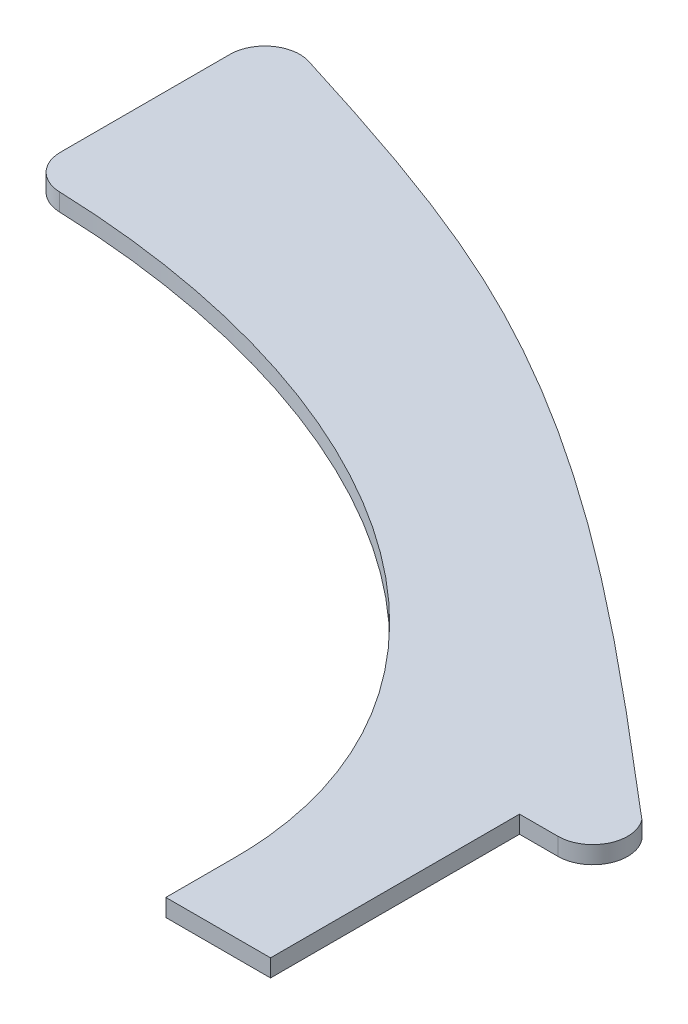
ISO-10303-21;
HEADER;
FILE_DESCRIPTION(('STEP AP214'),'2;1');
FILE_NAME('part.step','',(''),(''),'','','');
FILE_SCHEMA(('AUTOMOTIVE_DESIGN { 1 0 10303 214 1 1 1 1 }'));
ENDSEC;
DATA;
#1=APPLICATION_CONTEXT('core data for automotive mechanical design processes');
#2=APPLICATION_PROTOCOL_DEFINITION('international standard','automotive_design',2000,#1);
#3=PRODUCT_CONTEXT('',#1,'mechanical');
#4=PRODUCT('Part','Part','',(#3));
#5=PRODUCT_RELATED_PRODUCT_CATEGORY('part','',(#4));
#6=PRODUCT_DEFINITION_FORMATION('','',#4);
#7=PRODUCT_DEFINITION_CONTEXT('part definition',#1,'design');
#8=PRODUCT_DEFINITION('design','',#6,#7);
#9=PRODUCT_DEFINITION_SHAPE('','',#8);
#10=(LENGTH_UNIT() NAMED_UNIT(*) SI_UNIT(.MILLI.,.METRE.));
#11=(NAMED_UNIT(*) PLANE_ANGLE_UNIT() SI_UNIT($,.RADIAN.));
#12=(NAMED_UNIT(*) SI_UNIT($,.STERADIAN.) SOLID_ANGLE_UNIT());
#13=UNCERTAINTY_MEASURE_WITH_UNIT(LENGTH_MEASURE(1.E-05),#10,'distance_accuracy_value','');
#14=(GEOMETRIC_REPRESENTATION_CONTEXT(3) GLOBAL_UNCERTAINTY_ASSIGNED_CONTEXT((#13)) GLOBAL_UNIT_ASSIGNED_CONTEXT((#10,
#11,#12)) REPRESENTATION_CONTEXT('',''));
#15=CARTESIAN_POINT('',(0.,0.,0.));
#16=DIRECTION('',(0.,0.,1.));
#17=DIRECTION('',(1.,0.,0.));
#18=AXIS2_PLACEMENT_3D('',#15,#16,#17);
#19=CARTESIAN_POINT('',(-12.6572245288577,6.35,-65.1923829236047));
#20=DIRECTION('',(0.,0.,-1.));
#21=DIRECTION('',(-1.,0.,0.));
#22=AXIS2_PLACEMENT_3D('',#19,#20,#21);
#23=PLANE('',#22);
#24=DIRECTION('',(1.,0.,0.));
#25=VECTOR('',#24,1.);
#26=CARTESIAN_POINT('',(-12.6572245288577,0.,-65.1923829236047));
#27=LINE('',#26,#25);
#28=CARTESIAN_POINT('',(-12.6572245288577,0.,-65.1923829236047));
#29=VERTEX_POINT('',#28);
#30=CARTESIAN_POINT('',(1.32065538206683,0.,-65.1923829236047));
#31=VERTEX_POINT('',#30);
#32=EDGE_CURVE('E140',#29,#31,#27,.T.);
#33=ORIENTED_EDGE('',*,*,#32,.T.);
#34=DIRECTION('',(0.,-1.,0.));
#35=VECTOR('',#34,1.);
#36=CARTESIAN_POINT('',(1.32065538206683,6.35,-65.1923829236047));
#37=LINE('',#36,#35);
#38=CARTESIAN_POINT('',(1.32065538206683,6.35,-65.1923829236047));
#39=VERTEX_POINT('',#38);
#40=EDGE_CURVE('E11',#39,#31,#37,.T.);
#41=ORIENTED_EDGE('',*,*,#40,.F.);
#42=DIRECTION('',(1.,0.,0.));
#43=VECTOR('',#42,1.);
#44=CARTESIAN_POINT('',(-12.6572245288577,6.35,-65.1923829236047));
#45=LINE('',#44,#43);
#46=CARTESIAN_POINT('',(-12.6572245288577,6.35,-65.1923829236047));
#47=VERTEX_POINT('',#46);
#48=EDGE_CURVE('E165',#47,#39,#45,.T.);
#49=ORIENTED_EDGE('',*,*,#48,.F.);
#50=DIRECTION('',(0.,-1.,0.));
#51=VECTOR('',#50,1.);
#52=CARTESIAN_POINT('',(-12.6572245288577,6.35,-65.1923829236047));
#53=LINE('',#52,#51);
#54=EDGE_CURVE('E136',#47,#29,#53,.T.);
#55=ORIENTED_EDGE('',*,*,#54,.T.);
#56=EDGE_LOOP('',(#33,#41,#49,#55));
#57=FACE_BOUND('',#56,.T.);
#58=ADVANCED_FACE('F31',(#57),#23,.F.);
#59=CARTESIAN_POINT('',(1.32065538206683,6.35,-77.8923829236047));
#60=DIRECTION('',(0.,-1.,0.));
#61=DIRECTION('',(0.,0.,-1.));
#62=AXIS2_PLACEMENT_3D('',#59,#60,#61);
#63=CYLINDRICAL_SURFACE('',#62,12.7);
#64=CARTESIAN_POINT('',(1.32065538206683,0.,-77.8923829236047));
#65=DIRECTION('',(0.,1.,0.));
#66=DIRECTION('',(0.,0.,-1.));
#67=AXIS2_PLACEMENT_3D('',#64,#65,#66);
#68=CIRCLE('',#67,12.7);
#69=CARTESIAN_POINT('',(11.2864434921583,0.,-85.7646803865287));
#70=VERTEX_POINT('',#69);
#71=EDGE_CURVE('E143',#31,#70,#68,.T.);
#72=ORIENTED_EDGE('',*,*,#71,.T.);
#73=DIRECTION('',(0.,-1.,0.));
#74=VECTOR('',#73,1.);
#75=CARTESIAN_POINT('',(11.2864434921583,6.35,-85.7646803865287));
#76=LINE('',#75,#74);
#77=CARTESIAN_POINT('',(11.2864434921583,6.35,-85.7646803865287));
#78=VERTEX_POINT('',#77);
#79=EDGE_CURVE('E39',#78,#70,#76,.T.);
#80=ORIENTED_EDGE('',*,*,#79,.F.);
#81=CARTESIAN_POINT('',(1.32065538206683,6.35,-77.8923829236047));
#82=DIRECTION('',(0.,1.,0.));
#83=DIRECTION('',(0.,0.,-1.));
#84=AXIS2_PLACEMENT_3D('',#81,#82,#83);
#85=CIRCLE('',#84,12.7);
#86=EDGE_CURVE('E94',#39,#78,#85,.T.);
#87=ORIENTED_EDGE('',*,*,#86,.F.);
#88=ORIENTED_EDGE('',*,*,#40,.T.);
#89=EDGE_LOOP('',(#72,#80,#87,#88));
#90=FACE_BOUND('',#89,.T.);
#91=ADVANCED_FACE('F223',(#90),#63,.T.);
#92=CARTESIAN_POINT('',(11.2864434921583,6.35,-85.7646803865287));
#93=CARTESIAN_POINT('',(-51.9960826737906,6.35,-139.632547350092));
#94=CARTESIAN_POINT('',(-142.555462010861,6.35,-216.719239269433));
#95=CARTESIAN_POINT('',(-254.3779025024,6.35,-253.511407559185));
#96=CARTESIAN_POINT('',(-288.2826968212,6.35,-264.065032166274));
#97=B_SPLINE_CURVE_WITH_KNOTS('',3,(#92,#93,#94,#95,#96),.UNSPECIFIED.,.F.,.F.,(4,1,4),(0.,
0.666316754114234,0.953521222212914),.UNSPECIFIED.);
#98=DIRECTION('',(0.,-1.,0.));
#99=VECTOR('',#98,1.);
#100=SURFACE_OF_LINEAR_EXTRUSION('',#97,#99);
#101=CARTESIAN_POINT('',(11.2864434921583,0.,-85.7646803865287));
#102=CARTESIAN_POINT('',(-51.9960826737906,0.,-139.632547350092));
#103=CARTESIAN_POINT('',(-142.555462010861,0.,-216.719239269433));
#104=CARTESIAN_POINT('',(-254.3779025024,0.,-253.511407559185));
#105=CARTESIAN_POINT('',(-288.2826968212,0.,-264.065032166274));
#106=B_SPLINE_CURVE_WITH_KNOTS('',3,(#101,#102,#103,#104,#105),.UNSPECIFIED.,.F.,.F.,(4,1,4),
(0.,0.666316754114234,0.953521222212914),.UNSPECIFIED.);
#107=CARTESIAN_POINT('',(-288.2826968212,0.,-264.065032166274));
#108=VERTEX_POINT('',#107);
#109=EDGE_CURVE('E145',#70,#108,#106,.T.);
#110=ORIENTED_EDGE('',*,*,#109,.T.);
#111=DIRECTION('',(0.,-1.,0.));
#112=VECTOR('',#111,1.);
#113=CARTESIAN_POINT('',(-288.2826968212,6.35,-264.065032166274));
#114=LINE('',#113,#112);
#115=CARTESIAN_POINT('',(-288.2826968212,6.35,-264.065032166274));
#116=VERTEX_POINT('',#115);
#117=EDGE_CURVE('E178',#116,#108,#114,.T.);
#118=ORIENTED_EDGE('',*,*,#117,.F.);
#119=EDGE_CURVE('E186',#78,#116,#97,.T.);
#120=ORIENTED_EDGE('',*,*,#119,.F.);
#121=ORIENTED_EDGE('',*,*,#79,.T.);
#122=EDGE_LOOP('',(#110,#118,#120,#121));
#123=FACE_BOUND('',#122,.T.);
#124=ADVANCED_FACE('F184',(#123),#100,.F.);
#125=CARTESIAN_POINT('',(-292.057224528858,6.35,-251.938905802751));
#126=DIRECTION('',(0.,-1.,0.));
#127=DIRECTION('',(0.,0.,-1.));
#128=AXIS2_PLACEMENT_3D('',#125,#126,#127);
#129=CYLINDRICAL_SURFACE('',#128,12.7);
#130=CARTESIAN_POINT('',(-292.057224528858,0.,-251.938905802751));
#131=DIRECTION('',(0.,1.,0.));
#132=DIRECTION('',(0.,0.,1.));
#133=AXIS2_PLACEMENT_3D('',#130,#131,#132);
#134=CIRCLE('',#133,12.7);
#135=CARTESIAN_POINT('',(-304.757224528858,0.,-251.938905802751));
#136=VERTEX_POINT('',#135);
#137=EDGE_CURVE('E149',#108,#136,#134,.T.);
#138=ORIENTED_EDGE('',*,*,#137,.T.);
#139=DIRECTION('',(0.,-1.,0.));
#140=VECTOR('',#139,1.);
#141=CARTESIAN_POINT('',(-304.757224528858,6.35,-251.938905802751));
#142=LINE('',#141,#140);
#143=CARTESIAN_POINT('',(-304.757224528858,6.35,-251.938905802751));
#144=VERTEX_POINT('',#143);
#145=EDGE_CURVE('E175',#144,#136,#142,.T.);
#146=ORIENTED_EDGE('',*,*,#145,.F.);
#147=CARTESIAN_POINT('',(-292.057224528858,6.35,-251.938905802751));
#148=DIRECTION('',(0.,1.,0.));
#149=DIRECTION('',(0.,0.,1.));
#150=AXIS2_PLACEMENT_3D('',#147,#148,#149);
#151=CIRCLE('',#150,12.7);
#152=EDGE_CURVE('E201',#116,#144,#151,.T.);
#153=ORIENTED_EDGE('',*,*,#152,.F.);
#154=ORIENTED_EDGE('',*,*,#117,.T.);
#155=EDGE_LOOP('',(#138,#146,#153,#154));
#156=FACE_BOUND('',#155,.T.);
#157=ADVANCED_FACE('F192',(#156),#129,.T.);
#158=CARTESIAN_POINT('',(-304.757224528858,6.35,-202.348739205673));
#159=DIRECTION('',(1.,0.,1.19625711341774E-13));
#160=DIRECTION('',(1.19625711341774E-13,0.,-1.));
#161=AXIS2_PLACEMENT_3D('',#158,#159,#160);
#162=PLANE('',#161);
#163=DIRECTION('',(-1.19625711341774E-13,0.,1.));
#164=VECTOR('',#163,1.);
#165=CARTESIAN_POINT('',(-304.757224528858,0.,-202.348739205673));
#166=LINE('',#165,#164);
#167=CARTESIAN_POINT('',(-304.757224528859,0.,-190.283691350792));
#168=VERTEX_POINT('',#167);
#169=EDGE_CURVE('E155',#136,#168,#166,.T.);
#170=ORIENTED_EDGE('',*,*,#169,.T.);
#171=DIRECTION('',(0.,-1.,0.));
#172=VECTOR('',#171,1.);
#173=CARTESIAN_POINT('',(-304.757224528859,6.35,-190.283691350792));
#174=LINE('',#173,#172);
#175=CARTESIAN_POINT('',(-304.757224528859,6.35,-190.283691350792));
#176=VERTEX_POINT('',#175);
#177=EDGE_CURVE('E172',#176,#168,#174,.T.);
#178=ORIENTED_EDGE('',*,*,#177,.F.);
#179=DIRECTION('',(0.,0.,1.));
#180=VECTOR('',#179,1.);
#181=CARTESIAN_POINT('',(-304.757224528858,6.35,-202.348739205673));
#182=LINE('',#181,#180);
#183=EDGE_CURVE('E198',#144,#176,#182,.T.);
#184=ORIENTED_EDGE('',*,*,#183,.F.);
#185=ORIENTED_EDGE('',*,*,#145,.T.);
#186=EDGE_LOOP('',(#170,#178,#184,#185));
#187=FACE_BOUND('',#186,.T.);
#188=ADVANCED_FACE('F196',(#187),#162,.F.);
#189=CARTESIAN_POINT('',(-292.057224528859,6.35,-190.283691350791));
#190=DIRECTION('',(0.,-1.,0.));
#191=DIRECTION('',(0.,0.,-1.));
#192=AXIS2_PLACEMENT_3D('',#189,#190,#191);
#193=CYLINDRICAL_SURFACE('',#192,12.7);
#194=CARTESIAN_POINT('',(-292.057224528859,0.,-190.283691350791));
#195=DIRECTION('',(0.,1.,0.));
#196=DIRECTION('',(0.,0.,-1.));
#197=AXIS2_PLACEMENT_3D('',#194,#195,#196);
#198=CIRCLE('',#197,12.7);
#199=CARTESIAN_POINT('',(-292.488314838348,0.,-177.591009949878));
#200=VERTEX_POINT('',#199);
#201=EDGE_CURVE('E157',#168,#200,#198,.T.);
#202=ORIENTED_EDGE('',*,*,#201,.T.);
#203=DIRECTION('',(0.,-1.,0.));
#204=VECTOR('',#203,1.);
#205=CARTESIAN_POINT('',(-292.488314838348,6.35,-177.591009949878));
#206=LINE('',#205,#204);
#207=CARTESIAN_POINT('',(-292.488314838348,6.35,-177.591009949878));
#208=VERTEX_POINT('',#207);
#209=EDGE_CURVE('E169',#208,#200,#206,.T.);
#210=ORIENTED_EDGE('',*,*,#209,.F.);
#211=CARTESIAN_POINT('',(-292.057224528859,6.35,-190.283691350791));
#212=DIRECTION('',(0.,1.,0.));
#213=DIRECTION('',(0.,0.,-1.));
#214=AXIS2_PLACEMENT_3D('',#211,#212,#213);
#215=CIRCLE('',#214,12.7);
#216=EDGE_CURVE('E200',#176,#208,#215,.T.);
#217=ORIENTED_EDGE('',*,*,#216,.F.);
#218=ORIENTED_EDGE('',*,*,#177,.T.);
#219=EDGE_LOOP('',(#202,#210,#217,#218));
#220=FACE_BOUND('',#219,.T.);
#221=ADVANCED_FACE('F212',(#220),#193,.T.);
#222=CARTESIAN_POINT('',(-304.8,6.35,0.));
#223=DIRECTION('',(0.,-1.,0.));
#224=DIRECTION('',(0.999999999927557,0.,1.20368619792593E-05));
#225=AXIS2_PLACEMENT_3D('',#222,#223,#224);
#226=ELLIPSE('',#225,254.045643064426,177.8);
#227=DIRECTION('',(0.,-1.,0.));
#228=VECTOR('',#227,1.);
#229=SURFACE_OF_LINEAR_EXTRUSION('',#226,#228);
#230=CARTESIAN_POINT('',(-304.8,0.,0.));
#231=DIRECTION('',(0.,-1.,0.));
#232=DIRECTION('',(0.999999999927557,0.,1.20368619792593E-05));
#233=AXIS2_PLACEMENT_3D('',#230,#231,#232);
#234=ELLIPSE('',#233,254.045643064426,177.8);
#235=CARTESIAN_POINT('',(-50.7543569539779,0.,0.00305791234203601));
#236=VERTEX_POINT('',#235);
#237=EDGE_CURVE('E159',#200,#236,#234,.T.);
#238=ORIENTED_EDGE('',*,*,#237,.T.);
#239=DIRECTION('',(0.,-1.,0.));
#240=VECTOR('',#239,1.);
#241=CARTESIAN_POINT('',(-50.7543569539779,6.35,0.00305791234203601));
#242=LINE('',#241,#240);
#243=CARTESIAN_POINT('',(-50.7543569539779,6.35,0.00305791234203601));
#244=VERTEX_POINT('',#243);
#245=EDGE_CURVE('E131',#244,#236,#242,.T.);
#246=ORIENTED_EDGE('',*,*,#245,.F.);
#247=EDGE_CURVE('E120',#208,#244,#226,.T.);
#248=ORIENTED_EDGE('',*,*,#247,.F.);
#249=ORIENTED_EDGE('',*,*,#209,.T.);
#250=EDGE_LOOP('',(#238,#246,#248,#249));
#251=FACE_BOUND('',#250,.T.);
#252=ADVANCED_FACE('F208',(#251),#229,.F.);
#253=CARTESIAN_POINT('',(-50.7543569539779,6.35,0.00305791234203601));
#254=DIRECTION('',(1.,0.,0.));
#255=DIRECTION('',(0.,0.,-1.));
#256=AXIS2_PLACEMENT_3D('',#253,#254,#255);
#257=PLANE('',#256);
#258=DIRECTION('',(0.,0.,1.));
#259=VECTOR('',#258,1.);
#260=CARTESIAN_POINT('',(-50.7543569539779,0.,0.00305791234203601));
#261=LINE('',#260,#259);
#262=CARTESIAN_POINT('',(-50.7543569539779,0.,25.403057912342));
#263=VERTEX_POINT('',#262);
#264=EDGE_CURVE('E129',#236,#263,#261,.T.);
#265=ORIENTED_EDGE('',*,*,#264,.T.);
#266=DIRECTION('',(0.,-1.,0.));
#267=VECTOR('',#266,1.);
#268=CARTESIAN_POINT('',(-50.7543569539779,6.35,25.403057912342));
#269=LINE('',#268,#267);
#270=CARTESIAN_POINT('',(-50.7543569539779,6.35,25.403057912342));
#271=VERTEX_POINT('',#270);
#272=EDGE_CURVE('E126',#271,#263,#269,.T.);
#273=ORIENTED_EDGE('',*,*,#272,.F.);
#274=DIRECTION('',(0.,0.,1.));
#275=VECTOR('',#274,1.);
#276=CARTESIAN_POINT('',(-50.7543569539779,6.35,0.00305791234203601));
#277=LINE('',#276,#275);
#278=EDGE_CURVE('E113',#244,#271,#277,.T.);
#279=ORIENTED_EDGE('',*,*,#278,.F.);
#280=ORIENTED_EDGE('',*,*,#245,.T.);
#281=EDGE_LOOP('',(#265,#273,#279,#280));
#282=FACE_BOUND('',#281,.T.);
#283=ADVANCED_FACE('F127',(#282),#257,.F.);
#284=CARTESIAN_POINT('',(-50.7543569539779,6.35,25.403057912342));
#285=DIRECTION('',(0.,0.,-1.));
#286=DIRECTION('',(-1.,0.,0.));
#287=AXIS2_PLACEMENT_3D('',#284,#285,#286);
#288=PLANE('',#287);
#289=DIRECTION('',(1.,0.,0.));
#290=VECTOR('',#289,1.);
#291=CARTESIAN_POINT('',(-50.7543569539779,0.,25.403057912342));
#292=LINE('',#291,#290);
#293=CARTESIAN_POINT('',(-12.6572245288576,0.,25.403057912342));
#294=VERTEX_POINT('',#293);
#295=EDGE_CURVE('E162',#263,#294,#292,.T.);
#296=ORIENTED_EDGE('',*,*,#295,.T.);
#297=DIRECTION('',(0.,-1.,0.));
#298=VECTOR('',#297,1.);
#299=CARTESIAN_POINT('',(-12.6572245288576,6.35,25.403057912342));
#300=LINE('',#299,#298);
#301=CARTESIAN_POINT('',(-12.6572245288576,6.35,25.403057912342));
#302=VERTEX_POINT('',#301);
#303=EDGE_CURVE('E132',#302,#294,#300,.T.);
#304=ORIENTED_EDGE('',*,*,#303,.F.);
#305=DIRECTION('',(1.,0.,0.));
#306=VECTOR('',#305,1.);
#307=CARTESIAN_POINT('',(-50.7543569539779,6.35,25.403057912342));
#308=LINE('',#307,#306);
#309=EDGE_CURVE('E117',#271,#302,#308,.T.);
#310=ORIENTED_EDGE('',*,*,#309,.F.);
#311=ORIENTED_EDGE('',*,*,#272,.T.);
#312=EDGE_LOOP('',(#296,#304,#310,#311));
#313=FACE_BOUND('',#312,.T.);
#314=ADVANCED_FACE('F134',(#313),#288,.F.);
#315=CARTESIAN_POINT('',(-12.6572245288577,6.35,-2.91433543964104E-13));
#316=DIRECTION('',(-1.,0.,0.));
#317=DIRECTION('',(0.,0.,1.));
#318=AXIS2_PLACEMENT_3D('',#315,#316,#317);
#319=PLANE('',#318);
#320=DIRECTION('',(0.,0.,-1.));
#321=VECTOR('',#320,1.);
#322=CARTESIAN_POINT('',(-12.6572245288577,0.,-2.91433543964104E-13));
#323=LINE('',#322,#321);
#324=EDGE_CURVE('E82',#294,#29,#323,.T.);
#325=ORIENTED_EDGE('',*,*,#324,.T.);
#326=ORIENTED_EDGE('',*,*,#54,.F.);
#327=DIRECTION('',(0.,0.,-1.));
#328=VECTOR('',#327,1.);
#329=CARTESIAN_POINT('',(-12.6572245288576,6.35,25.403057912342));
#330=LINE('',#329,#328);
#331=EDGE_CURVE('E47',#302,#47,#330,.T.);
#332=ORIENTED_EDGE('',*,*,#331,.F.);
#333=ORIENTED_EDGE('',*,*,#303,.T.);
#334=EDGE_LOOP('',(#325,#326,#332,#333));
#335=FACE_BOUND('',#334,.T.);
#336=ADVANCED_FACE('F292',(#335),#319,.F.);
#337=CARTESIAN_POINT('',(1.32065538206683,6.35,-77.8923829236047));
#338=DIRECTION('',(0.,-1.,0.));
#339=DIRECTION('',(0.,0.,-1.));
#340=AXIS2_PLACEMENT_3D('',#337,#338,#339);
#341=PLANE('',#340);
#342=ORIENTED_EDGE('',*,*,#48,.T.);
#343=ORIENTED_EDGE('',*,*,#86,.T.);
#344=ORIENTED_EDGE('',*,*,#119,.T.);
#345=ORIENTED_EDGE('',*,*,#152,.T.);
#346=ORIENTED_EDGE('',*,*,#183,.T.);
#347=ORIENTED_EDGE('',*,*,#216,.T.);
#348=ORIENTED_EDGE('',*,*,#247,.T.);
#349=ORIENTED_EDGE('',*,*,#278,.T.);
#350=ORIENTED_EDGE('',*,*,#309,.T.);
#351=ORIENTED_EDGE('',*,*,#331,.T.);
#352=EDGE_LOOP('',(#342,#343,#344,#345,#346,#347,#348,#349,#350,#351));
#353=FACE_BOUND('',#352,.T.);
#354=ADVANCED_FACE('F115',(#353),#341,.F.);
#355=CARTESIAN_POINT('',(1.32065538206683,0.,-77.8923829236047));
#356=DIRECTION('',(0.,-1.,0.));
#357=DIRECTION('',(0.,0.,-1.));
#358=AXIS2_PLACEMENT_3D('',#355,#356,#357);
#359=PLANE('',#358);
#360=ORIENTED_EDGE('',*,*,#32,.F.);
#361=ORIENTED_EDGE('',*,*,#324,.F.);
#362=ORIENTED_EDGE('',*,*,#295,.F.);
#363=ORIENTED_EDGE('',*,*,#264,.F.);
#364=ORIENTED_EDGE('',*,*,#237,.F.);
#365=ORIENTED_EDGE('',*,*,#201,.F.);
#366=ORIENTED_EDGE('',*,*,#169,.F.);
#367=ORIENTED_EDGE('',*,*,#137,.F.);
#368=ORIENTED_EDGE('',*,*,#109,.F.);
#369=ORIENTED_EDGE('',*,*,#71,.F.);
#370=EDGE_LOOP('',(#360,#361,#362,#363,#364,#365,#366,#367,#368,#369));
#371=FACE_BOUND('',#370,.T.);
#372=ADVANCED_FACE('F188',(#371),#359,.T.);
#373=CLOSED_SHELL('',(#58,#91,#124,#157,#188,#221,#252,#283,#314,#336,#354,#372));
#374=MANIFOLD_SOLID_BREP('B2',#373);
#375=ADVANCED_BREP_SHAPE_REPRESENTATION('',(#18,#374),#14);
#376=SHAPE_DEFINITION_REPRESENTATION(#9,#375);
ENDSEC;
END-ISO-10303-21;
